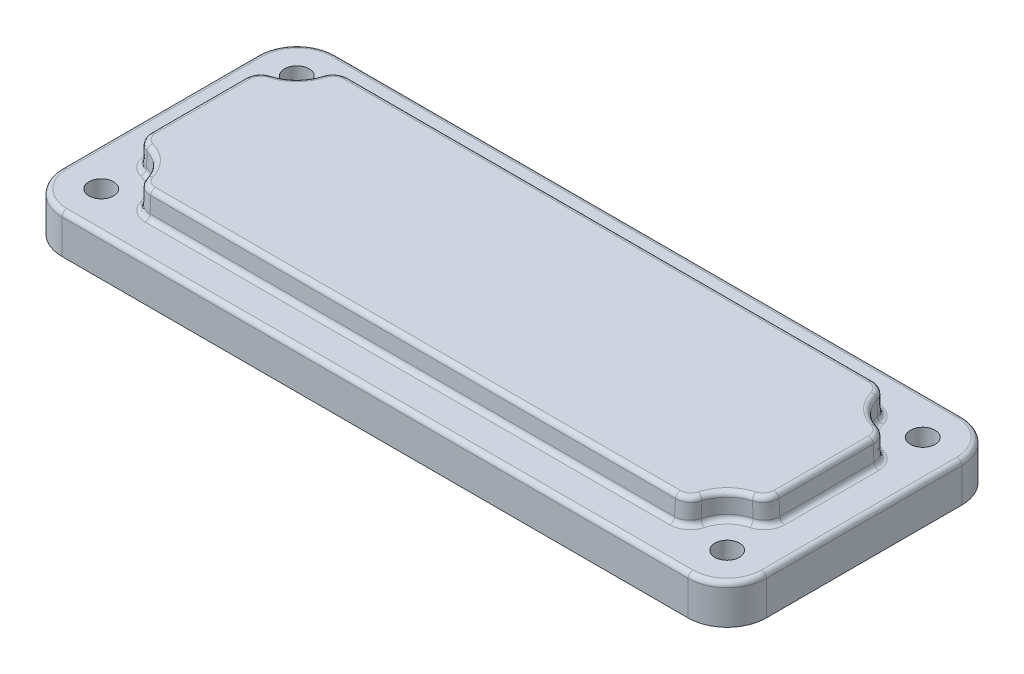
from build123d import *

# Parameters (mm, degrees)
BASE_EXTRUDE_DEPTH      = 6.35
BOSS_EXTRUDE1_DEPTH     = 4
BOSS_EXTRUDE1_TAPER     = 2.999999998
CUT_EXTRUDE1_START      = -4
SKETCH3_R               = 6
CUT_EXTRUDE1_DEPTH      = 4
SKETCH4_R               = 2
CUT_EXTRUDE2_DEPTH      = 62.647348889
MIRROR2_START           = -4
MIRROR2_COPY_1_SKETCH_R = 6
MIRROR2_COPY_1_DEPTH    = 4
MIRROR2_COPY_2_SKETCH_R = 2
MIRROR2_COPY_2_DEPTH    = 62.647348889
FILLET1_R               = 2.54
FILLET2_R               = 0.79375
SKETCH5_W               = 88.9
SKETCH5_H               = 31.75
CUT_EXTRUDE3_DEPTH      = 6.35
CUT_EXTRUDE3_DRAFT      = -2.999999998
FILLET3_R               = 6.35
FILLET4_R               = 3.175


with BuildPart() as part:
    # Sketch1 → Base-Extrude (new body)
    with BuildSketch(Plane(origin=(0, 0, 0), x_dir=(1, 0, 0), z_dir=(0, 1, 0))):
        with BuildLine():
            Line((-50.8, 22.225), (50.8, 22.225))
            ThreePointArc((50.8, 22.225), (55.290128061, 20.365128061), (57.15, 15.875))
            Line((57.15, 15.875), (57.15, -15.875))
            ThreePointArc((57.15, -15.875), (55.290128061, -20.365128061), (50.8, -22.225))
            Line((50.8, -22.225), (-50.8, -22.225))
            ThreePointArc((-50.8, -22.225), (-55.290128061, -20.365128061), (-57.15, -15.875))
            Line((-57.15, -15.875), (-57.15, 15.875))
            ThreePointArc((-57.15, 15.875), (-55.290128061, 20.365128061), (-50.8, 22.225))
        make_face()
    extrude(amount=BASE_EXTRUDE_DEPTH)

    # Sketch2 → Boss-Extrude1 (add)
    with BuildSketch(Plane(origin=(0, 6.35, 0), x_dir=(-1, 0, 0), z_dir=(0, 1, 0))):
        with BuildLine():
            Line((50.8, 16.225), (-50.8, 16.225))
            ThreePointArc((-50.8, 16.225), (-51.047487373, 16.122487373), (-51.15, 15.875))
            Line((-51.15, 15.875), (-51.15, -15.875))
            ThreePointArc((-51.15, -15.875), (-51.047487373, -16.122487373), (-50.8, -16.225))
            Line((-50.8, -16.225), (50.8, -16.225))
            ThreePointArc((50.8, -16.225), (51.047487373, -16.122487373), (51.15, -15.875))
            Line((51.15, -15.875), (51.15, 15.875))
            ThreePointArc((51.15, 15.875), (51.047487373, 16.122487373), (50.8, 16.225))
        make_face()
    extrude(amount=BOSS_EXTRUDE1_DEPTH, taper=BOSS_EXTRUDE1_TAPER)

    # Sketch3 → Cut-Extrude1 (cut)
    with BuildSketch(Plane(origin=(0, 10.35, 0), x_dir=(-1, 0, 0), z_dir=(0, 1, 0)).offset(CUT_EXTRUDE1_START)):
        with Locations((-50.8, 15.875)):
            Circle(SKETCH3_R)
    cut_extrude1 = extrude(amount=CUT_EXTRUDE1_DEPTH, mode=Mode.SUBTRACT)

    # Sketch4 → Cut-Extrude2 (cut, through all)
    with BuildSketch(Plane(origin=(0, 6.35, 0), x_dir=(-1, 0, 0), z_dir=(0, 1, 0))):
        with Locations(Location((-50.8, 15.875, 0), (0, 0, 90))):
            Circle(SKETCH4_R)
    cut_extrude2 = extrude(amount=-CUT_EXTRUDE2_DEPTH, mode=Mode.SUBTRACT)

    # Mirror1: Cut-Extrude1, Cut-Extrude2 across plane
    add(cut_extrude1.mirror(Plane.XY), mode=Mode.SUBTRACT)
    add(cut_extrude2.mirror(Plane.XY), mode=Mode.SUBTRACT)

    # Mirror2: Cut-Extrude1, Cut-Extrude2 across plane
    add(cut_extrude1.mirror(Plane(origin=(0, 0, 0), x_dir=(0, 0, 1), z_dir=(1, 0, 0))), mode=Mode.SUBTRACT)
    add(cut_extrude2.mirror(Plane(origin=(0, 0, 0), x_dir=(0, 0, 1), z_dir=(1, 0, 0))), mode=Mode.SUBTRACT)

    # Mirror2 copy 1 sketch → Mirror2 copy 1 (cut)
    with BuildSketch(Plane(origin=(0, 10.35, 0), x_dir=(1, 0, 0), z_dir=(0, 1, 0)).offset(MIRROR2_START)):
        with Locations((-50.8, 15.875)):
            Circle(MIRROR2_COPY_1_SKETCH_R)
    extrude(amount=MIRROR2_COPY_1_DEPTH, mode=Mode.SUBTRACT)

    # Mirror2 copy 2 sketch → Mirror2 copy 2 (cut, through all)
    with BuildSketch(Plane(origin=(0, 6.35, 0), x_dir=(1, 0, 0), z_dir=(0, 1, 0))):
        with Locations(Location((-50.8, 15.875, 0), (0, 0, 90))):
            Circle(MIRROR2_COPY_2_SKETCH_R)
    extrude(amount=-MIRROR2_COPY_2_DEPTH, mode=Mode.SUBTRACT)

    # Fillet1
    fillet1_edges = [part.edges().sort_by_distance(p)[0] for p in [
        (-51.045184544, 8.349998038, 9.880011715),
        (51.045184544, 8.349998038, 9.880011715),
        (44.805011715, 8.349998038, 16.120184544),
        (51.045184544, 8.349998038, -9.880011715),
        (44.805011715, 8.349998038, -16.120184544),
        (-51.045184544, 8.349998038, -9.880011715),
        (-44.805011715, 8.349998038, -16.120184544),
        (-44.805011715, 8.349998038, 16.120184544),
    ]]
    fillet(fillet1_edges, radius=FILLET1_R)

    # Fillet2
    fillet2_edges = [part.edges().sort_by_distance(p)[0] for p in [
        (55.290128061, 6.35, 20.365128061),
        (4e-09, 6.35, 16.225),
        (4.2e-08, 10.35, 16.015368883),
        (-50.940368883, 10.35, 4.2e-08),
        (-46.557359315, 10.35, 11.632359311),
        (46.557359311, 10.35, 11.632359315),
        (50.940368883, 10.35, -4.2e-08),
        (46.557359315, 10.35, -11.632359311),
        (-4.2e-08, 10.35, -16.015368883),
        (-46.557359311, 10.35, -11.632359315),
        (-44.127230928, 10.35, 15.507066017),
        (-50.432066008, 10.35, 9.202230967),
        (-50.432066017, 10.35, -9.202230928),
        (-44.127230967, 10.35, -15.507066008),
        (44.127230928, 10.35, -15.507066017),
        (50.432066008, 10.35, -9.202230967),
        (50.432066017, 10.35, 9.202230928),
        (44.127230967, 10.35, 15.507066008),
        (46.557359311, 6.35, 11.632359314),
        (51.15, 6.35, -4e-09),
        (46.557359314, 6.35, -11.632359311),
        (57.15, 6.35, 0),
        (-4e-09, 6.35, -16.225),
        (-46.557359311, 6.35, -11.632359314),
        (-51.15, 6.35, 4e-09),
        (-46.557359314, 6.35, 11.632359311),
        (44.094548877, 6.35, 15.697104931),
        (50.622104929, 6.35, 9.169548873),
        (50.622104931, 6.35, -9.169548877),
        (44.094548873, 6.35, -15.69710493),
        (-44.094548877, 6.35, -15.69710493),
        (-50.62210493, 6.35, -9.169548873),
        (-50.62210493, 6.35, 9.169548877),
        (-44.094548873, 6.35, 15.697104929),
        (55.290128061, 6.35, -20.365128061),
        (0, 6.35, -22.225),
        (-55.290128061, 6.35, -20.365128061),
        (-57.15, 6.35, 0),
        (-55.290128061, 6.35, 20.365128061),
        (0, 6.35, 22.225),
    ]]
    fillet(fillet2_edges, radius=FILLET2_R)


with BuildPart() as cut_extrude3_tool:
    # Sketch5 → Cut-Extrude3 (with draft: the straight prism first)
    with BuildSketch(Plane.XZ):
        Rectangle(SKETCH5_W, SKETCH5_H)
    extrude(amount=-CUT_EXTRUDE3_DEPTH)
    # Cut-Extrude3: the draft: its side faces are tilted about the plane it starts from
    cut_extrude3_sides = [cut_extrude3_tool.faces().sort_by_distance(p)[0] for p in [
        (-44.45, 3.175, 0),
        (0, 3.175, -15.875),
        (44.45, 3.175, 0),
        (0, 3.175, 15.875),
    ]]
    draft(cut_extrude3_sides, Plane.XZ, CUT_EXTRUDE3_DRAFT)


with BuildPart() as part_1:
    add(part.part)

    # Cut-Extrude3: cut by cut_extrude3_tool
    add(cut_extrude3_tool.part, mode=Mode.SUBTRACT)

    # Fillet3
    fillet3_edges = [part_1.edges().sort_by_distance(p)[0] for p in [
        (-44.283605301, 3.175, -15.708605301),
        (-44.283605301, 3.175, 15.708605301),
        (44.283605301, 3.175, 15.708605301),
        (44.283605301, 3.175, -15.708605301),
    ]]
    fillet(fillet3_edges, radius=FILLET3_R)

    # Fillet4
    fillet4_edges = [part_1.edges().sort_by_distance(p)[0] for p in [
        (-44.117210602, 6.35, 0),
        (0, 6.35, 15.542210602),
        (0, 6.35, -15.542210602),
        (44.117210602, 6.35, 0),
        (-42.260939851, 6.35, -13.685939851),
        (42.260939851, 6.35, 13.685939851),
        (42.260939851, 6.35, -13.685939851),
        (-42.260939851, 6.35, 13.685939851),
    ]]
    fillet(fillet4_edges, radius=FILLET4_R)


solid = part_1.part
